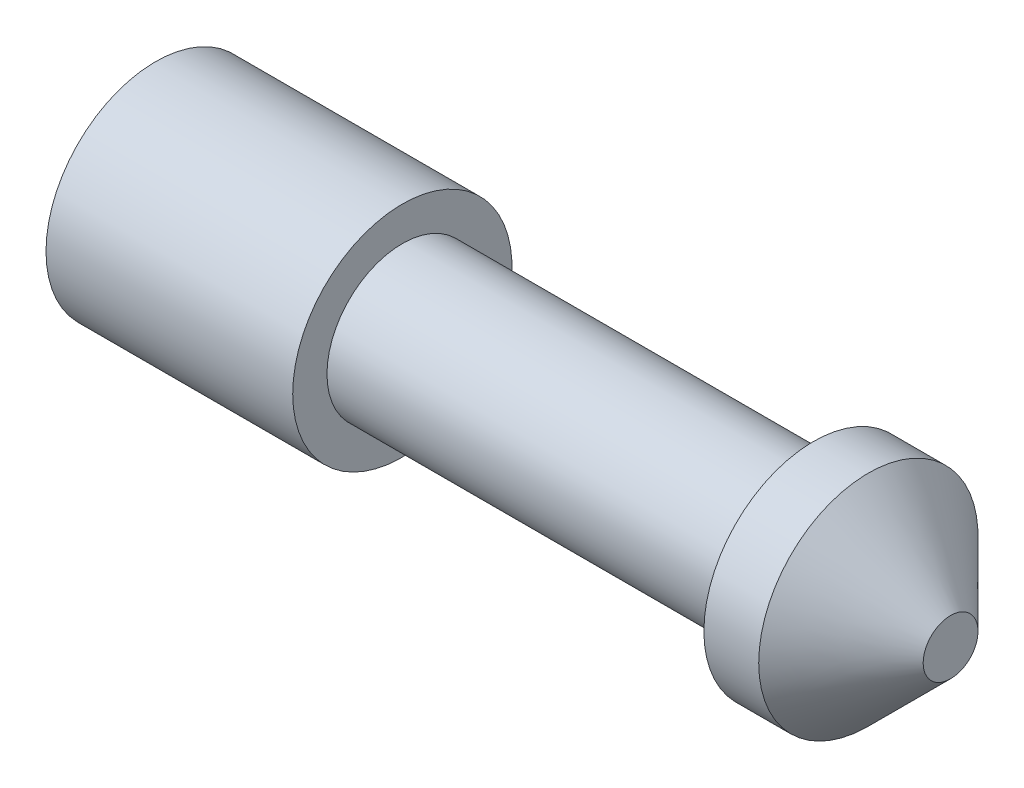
from build123d import *


with BuildPart() as part:
    # Sketch1 → Revolve1 (revolve)
    with BuildSketch(Plane(origin=(0, 0, 0), x_dir=(1, 0, 0), z_dir=(0, 1, 0)), mode=Mode.PRIVATE) as revolve1_sk:
        Polygon((0, 4), (0, 0), (29, 0), (29, 1), (26, 4), (24, 4), (24, 2.75), (9, 2.75), (9, 4), align=None)
    revolve(revolve1_sk.sketch.rotate(Axis((0, 0, 0), (1, 0, 0)), 180), axis=Axis((0, 0, 0), (1, 0, 0)))


solid = part.part
